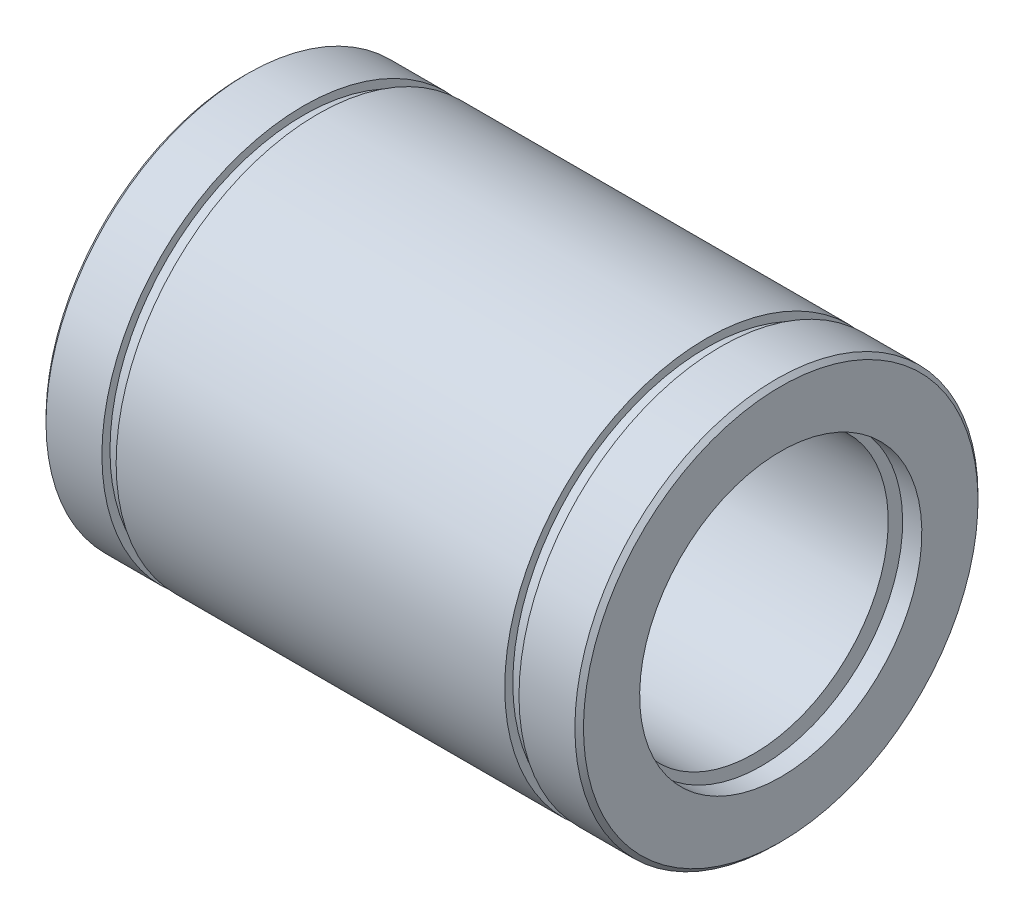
ISO-10303-21;
HEADER;
FILE_DESCRIPTION(('STEP AP214'),'2;1');
FILE_NAME('part.step','',(''),(''),'','','');
FILE_SCHEMA(('AUTOMOTIVE_DESIGN { 1 0 10303 214 1 1 1 1 }'));
ENDSEC;
DATA;
#1=APPLICATION_CONTEXT('core data for automotive mechanical design processes');
#2=APPLICATION_PROTOCOL_DEFINITION('international standard','automotive_design',2000,#1);
#3=PRODUCT_CONTEXT('',#1,'mechanical');
#4=PRODUCT('Part','Part','',(#3));
#5=PRODUCT_RELATED_PRODUCT_CATEGORY('part','',(#4));
#6=PRODUCT_DEFINITION_FORMATION('','',#4);
#7=PRODUCT_DEFINITION_CONTEXT('part definition',#1,'design');
#8=PRODUCT_DEFINITION('design','',#6,#7);
#9=PRODUCT_DEFINITION_SHAPE('','',#8);
#10=(LENGTH_UNIT() NAMED_UNIT(*) SI_UNIT(.MILLI.,.METRE.));
#11=(NAMED_UNIT(*) PLANE_ANGLE_UNIT() SI_UNIT($,.RADIAN.));
#12=(NAMED_UNIT(*) SI_UNIT($,.STERADIAN.) SOLID_ANGLE_UNIT());
#13=UNCERTAINTY_MEASURE_WITH_UNIT(LENGTH_MEASURE(1.E-05),#10,'distance_accuracy_value','');
#14=(GEOMETRIC_REPRESENTATION_CONTEXT(3) GLOBAL_UNCERTAINTY_ASSIGNED_CONTEXT((#13)) GLOBAL_UNIT_ASSIGNED_CONTEXT((#10,
#11,#12)) REPRESENTATION_CONTEXT('',''));
#15=CARTESIAN_POINT('',(0.,0.,0.));
#16=DIRECTION('',(0.,0.,1.));
#17=DIRECTION('',(1.,0.,0.));
#18=AXIS2_PLACEMENT_3D('',#15,#16,#17);
#19=CARTESIAN_POINT('',(0.,31.475,0.));
#20=DIRECTION('',(-1.,0.,0.));
#21=DIRECTION('',(0.,0.,1.));
#22=AXIS2_PLACEMENT_3D('',#19,#20,#21);
#23=PLANE('',#22);
#24=CARTESIAN_POINT('',(0.,0.,0.));
#25=DIRECTION('',(-1.,0.,0.));
#26=DIRECTION('',(0.,1.,0.));
#27=AXIS2_PLACEMENT_3D('',#24,#25,#26);
#28=CIRCLE('',#27,26.25);
#29=CARTESIAN_POINT('',(0.,-26.25,0.));
#30=VERTEX_POINT('',#29);
#31=EDGE_CURVE('E179',#30,#30,#28,.T.);
#32=ORIENTED_EDGE('',*,*,#31,.F.);
#33=EDGE_LOOP('',(#32));
#34=FACE_BOUND('',#33,.T.);
#35=CARTESIAN_POINT('',(0.,0.,0.));
#36=DIRECTION('',(-1.,0.,0.));
#37=DIRECTION('',(0.,1.,0.));
#38=AXIS2_PLACEMENT_3D('',#35,#36,#37);
#39=CIRCLE('',#38,36.7);
#40=CARTESIAN_POINT('',(0.,-36.7,0.));
#41=VERTEX_POINT('',#40);
#42=EDGE_CURVE('E140',#41,#41,#39,.T.);
#43=ORIENTED_EDGE('',*,*,#42,.T.);
#44=EDGE_LOOP('',(#43));
#45=FACE_BOUND('',#44,.T.);
#46=ADVANCED_FACE('F16',(#34,#45),#23,.T.);
#47=CARTESIAN_POINT('',(100.,31.475,0.));
#48=DIRECTION('',(1.,0.,0.));
#49=DIRECTION('',(0.,1.,0.));
#50=AXIS2_PLACEMENT_3D('',#47,#48,#49);
#51=PLANE('',#50);
#52=CARTESIAN_POINT('',(100.,0.,0.));
#53=DIRECTION('',(-1.,0.,0.));
#54=DIRECTION('',(0.,1.,0.));
#55=AXIS2_PLACEMENT_3D('',#52,#53,#54);
#56=CIRCLE('',#55,26.25);
#57=CARTESIAN_POINT('',(100.,-26.25,0.));
#58=VERTEX_POINT('',#57);
#59=EDGE_CURVE('E174',#58,#58,#56,.T.);
#60=ORIENTED_EDGE('',*,*,#59,.T.);
#61=EDGE_LOOP('',(#60));
#62=FACE_BOUND('',#61,.T.);
#63=CARTESIAN_POINT('',(100.,0.,0.));
#64=DIRECTION('',(-1.,0.,0.));
#65=DIRECTION('',(0.,1.,0.));
#66=AXIS2_PLACEMENT_3D('',#63,#64,#65);
#67=CIRCLE('',#66,36.7);
#68=CARTESIAN_POINT('',(100.,-36.7,0.));
#69=VERTEX_POINT('',#68);
#70=EDGE_CURVE('E192',#69,#69,#67,.T.);
#71=ORIENTED_EDGE('',*,*,#70,.F.);
#72=EDGE_LOOP('',(#71));
#73=FACE_BOUND('',#72,.T.);
#74=ADVANCED_FACE('F274',(#62,#73),#51,.T.);
#75=CARTESIAN_POINT('',(96.4285714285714,27.5,0.));
#76=DIRECTION('',(-1.,0.,0.));
#77=DIRECTION('',(0.,0.,1.));
#78=AXIS2_PLACEMENT_3D('',#75,#76,#77);
#79=PLANE('',#78);
#80=CARTESIAN_POINT('',(96.4285714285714,0.,0.));
#81=DIRECTION('',(-1.,0.,0.));
#82=DIRECTION('',(0.,1.,0.));
#83=AXIS2_PLACEMENT_3D('',#80,#81,#82);
#84=CIRCLE('',#83,26.25);
#85=CARTESIAN_POINT('',(96.4285714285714,-26.25,0.));
#86=VERTEX_POINT('',#85);
#87=EDGE_CURVE('E175',#86,#86,#84,.T.);
#88=ORIENTED_EDGE('',*,*,#87,.F.);
#89=EDGE_LOOP('',(#88));
#90=FACE_BOUND('',#89,.T.);
#91=CARTESIAN_POINT('',(96.4285714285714,0.,0.));
#92=DIRECTION('',(-1.,0.,0.));
#93=DIRECTION('',(0.,1.,0.));
#94=AXIS2_PLACEMENT_3D('',#91,#92,#93);
#95=CIRCLE('',#94,28.75);
#96=CARTESIAN_POINT('',(96.4285714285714,-28.75,0.));
#97=VERTEX_POINT('',#96);
#98=EDGE_CURVE('E156',#97,#97,#95,.T.);
#99=ORIENTED_EDGE('',*,*,#98,.T.);
#100=EDGE_LOOP('',(#99));
#101=FACE_BOUND('',#100,.T.);
#102=ADVANCED_FACE('F279',(#90,#101),#79,.T.);
#103=CARTESIAN_POINT('',(95.,26.875,0.));
#104=DIRECTION('',(1.,0.,0.));
#105=DIRECTION('',(0.,1.,0.));
#106=AXIS2_PLACEMENT_3D('',#103,#104,#105);
#107=PLANE('',#106);
#108=CARTESIAN_POINT('',(95.,0.,0.));
#109=DIRECTION('',(-1.,0.,0.));
#110=DIRECTION('',(0.,1.,0.));
#111=AXIS2_PLACEMENT_3D('',#108,#109,#110);
#112=CIRCLE('',#111,25.);
#113=CARTESIAN_POINT('',(95.,-25.,0.));
#114=VERTEX_POINT('',#113);
#115=EDGE_CURVE('E213',#114,#114,#112,.T.);
#116=ORIENTED_EDGE('',*,*,#115,.T.);
#117=EDGE_LOOP('',(#116));
#118=FACE_BOUND('',#117,.T.);
#119=CARTESIAN_POINT('',(95.,0.,0.));
#120=DIRECTION('',(-1.,0.,0.));
#121=DIRECTION('',(0.,1.,0.));
#122=AXIS2_PLACEMENT_3D('',#119,#120,#121);
#123=CIRCLE('',#122,28.75);
#124=CARTESIAN_POINT('',(95.,-28.75,0.));
#125=VERTEX_POINT('',#124);
#126=EDGE_CURVE('E157',#125,#125,#123,.T.);
#127=ORIENTED_EDGE('',*,*,#126,.F.);
#128=EDGE_LOOP('',(#127));
#129=FACE_BOUND('',#128,.T.);
#130=ADVANCED_FACE('F298',(#118,#129),#107,.T.);
#131=CARTESIAN_POINT('',(5.,26.875,0.));
#132=DIRECTION('',(-1.,0.,0.));
#133=DIRECTION('',(0.,0.,1.));
#134=AXIS2_PLACEMENT_3D('',#131,#132,#133);
#135=PLANE('',#134);
#136=CARTESIAN_POINT('',(5.,0.,0.));
#137=DIRECTION('',(-1.,0.,0.));
#138=DIRECTION('',(0.,1.,0.));
#139=AXIS2_PLACEMENT_3D('',#136,#137,#138);
#140=CIRCLE('',#139,25.);
#141=CARTESIAN_POINT('',(5.,-25.,0.));
#142=VERTEX_POINT('',#141);
#143=EDGE_CURVE('E195',#142,#142,#140,.T.);
#144=ORIENTED_EDGE('',*,*,#143,.F.);
#145=EDGE_LOOP('',(#144));
#146=FACE_BOUND('',#145,.T.);
#147=CARTESIAN_POINT('',(5.,0.,0.));
#148=DIRECTION('',(-1.,0.,0.));
#149=DIRECTION('',(0.,1.,0.));
#150=AXIS2_PLACEMENT_3D('',#147,#148,#149);
#151=CIRCLE('',#150,28.75);
#152=CARTESIAN_POINT('',(5.,-28.75,0.));
#153=VERTEX_POINT('',#152);
#154=EDGE_CURVE('E184',#153,#153,#151,.T.);
#155=ORIENTED_EDGE('',*,*,#154,.T.);
#156=EDGE_LOOP('',(#155));
#157=FACE_BOUND('',#156,.T.);
#158=ADVANCED_FACE('F290',(#146,#157),#135,.T.);
#159=CARTESIAN_POINT('',(3.57142857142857,27.5,0.));
#160=DIRECTION('',(1.,0.,0.));
#161=DIRECTION('',(0.,-1.,0.));
#162=AXIS2_PLACEMENT_3D('',#159,#160,#161);
#163=PLANE('',#162);
#164=CARTESIAN_POINT('',(3.57142857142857,0.,0.));
#165=DIRECTION('',(-1.,0.,0.));
#166=DIRECTION('',(0.,1.,0.));
#167=AXIS2_PLACEMENT_3D('',#164,#165,#166);
#168=CIRCLE('',#167,26.25);
#169=CARTESIAN_POINT('',(3.57142857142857,-26.25,0.));
#170=VERTEX_POINT('',#169);
#171=EDGE_CURVE('E229',#170,#170,#168,.T.);
#172=ORIENTED_EDGE('',*,*,#171,.T.);
#173=EDGE_LOOP('',(#172));
#174=FACE_BOUND('',#173,.T.);
#175=CARTESIAN_POINT('',(3.57142857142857,0.,0.));
#176=DIRECTION('',(-1.,0.,0.));
#177=DIRECTION('',(0.,1.,0.));
#178=AXIS2_PLACEMENT_3D('',#175,#176,#177);
#179=CIRCLE('',#178,28.75);
#180=CARTESIAN_POINT('',(3.57142857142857,-28.75,0.));
#181=VERTEX_POINT('',#180);
#182=EDGE_CURVE('E216',#181,#181,#179,.T.);
#183=ORIENTED_EDGE('',*,*,#182,.F.);
#184=EDGE_LOOP('',(#183));
#185=FACE_BOUND('',#184,.T.);
#186=ADVANCED_FACE('F287',(#174,#185),#163,.T.);
#187=CARTESIAN_POINT('',(11.2,0.,0.));
#188=DIRECTION('',(1.,0.,0.));
#189=DIRECTION('',(0.,1.,0.));
#190=AXIS2_PLACEMENT_3D('',#187,#188,#189);
#191=PLANE('',#190);
#192=CARTESIAN_POINT('',(11.2,0.,0.));
#193=DIRECTION('',(1.,0.,0.));
#194=DIRECTION('',(0.,0.,-1.));
#195=AXIS2_PLACEMENT_3D('',#192,#193,#194);
#196=CIRCLE('',#195,36.);
#197=CARTESIAN_POINT('',(11.2,0.,36.));
#198=VERTEX_POINT('',#197);
#199=EDGE_CURVE('E133',#198,#198,#196,.T.);
#200=ORIENTED_EDGE('',*,*,#199,.F.);
#201=EDGE_LOOP('',(#200));
#202=FACE_BOUND('',#201,.T.);
#203=CARTESIAN_POINT('',(11.2,0.,0.));
#204=DIRECTION('',(-1.,0.,0.));
#205=DIRECTION('',(0.,1.,0.));
#206=AXIS2_PLACEMENT_3D('',#203,#204,#205);
#207=CIRCLE('',#206,37.5);
#208=CARTESIAN_POINT('',(11.2,-37.5,0.));
#209=VERTEX_POINT('',#208);
#210=EDGE_CURVE('E131',#209,#209,#207,.T.);
#211=ORIENTED_EDGE('',*,*,#210,.F.);
#212=EDGE_LOOP('',(#211));
#213=FACE_BOUND('',#212,.T.);
#214=ADVANCED_FACE('F268',(#202,#213),#191,.T.);
#215=CARTESIAN_POINT('',(13.85,0.,0.));
#216=DIRECTION('',(1.,0.,0.));
#217=DIRECTION('',(0.,1.,0.));
#218=AXIS2_PLACEMENT_3D('',#215,#216,#217);
#219=PLANE('',#218);
#220=CARTESIAN_POINT('',(13.85,0.,0.));
#221=DIRECTION('',(1.,0.,0.));
#222=DIRECTION('',(0.,0.,-1.));
#223=AXIS2_PLACEMENT_3D('',#220,#221,#222);
#224=CIRCLE('',#223,36.);
#225=CARTESIAN_POINT('',(13.85,0.,36.));
#226=VERTEX_POINT('',#225);
#227=EDGE_CURVE('E237',#226,#226,#224,.T.);
#228=ORIENTED_EDGE('',*,*,#227,.T.);
#229=EDGE_LOOP('',(#228));
#230=FACE_BOUND('',#229,.T.);
#231=CARTESIAN_POINT('',(13.85,0.,0.));
#232=DIRECTION('',(1.,0.,0.));
#233=DIRECTION('',(0.,1.,0.));
#234=AXIS2_PLACEMENT_3D('',#231,#232,#233);
#235=CIRCLE('',#234,37.5);
#236=CARTESIAN_POINT('',(13.85,-37.5,0.));
#237=VERTEX_POINT('',#236);
#238=EDGE_CURVE('E158',#237,#237,#235,.T.);
#239=ORIENTED_EDGE('',*,*,#238,.F.);
#240=EDGE_LOOP('',(#239));
#241=FACE_BOUND('',#240,.T.);
#242=ADVANCED_FACE('F258',(#230,#241),#219,.F.);
#243=CARTESIAN_POINT('',(88.8,0.,0.));
#244=DIRECTION('',(1.,0.,0.));
#245=DIRECTION('',(0.,1.,0.));
#246=AXIS2_PLACEMENT_3D('',#243,#244,#245);
#247=PLANE('',#246);
#248=CARTESIAN_POINT('',(88.8,0.,0.));
#249=DIRECTION('',(1.,0.,0.));
#250=DIRECTION('',(0.,0.,-1.));
#251=AXIS2_PLACEMENT_3D('',#248,#249,#250);
#252=CIRCLE('',#251,36.);
#253=CARTESIAN_POINT('',(88.8,0.,36.));
#254=VERTEX_POINT('',#253);
#255=EDGE_CURVE('E166',#254,#254,#252,.T.);
#256=ORIENTED_EDGE('',*,*,#255,.T.);
#257=EDGE_LOOP('',(#256));
#258=FACE_BOUND('',#257,.T.);
#259=CARTESIAN_POINT('',(88.8,0.,0.));
#260=DIRECTION('',(1.,0.,0.));
#261=DIRECTION('',(0.,1.,0.));
#262=AXIS2_PLACEMENT_3D('',#259,#260,#261);
#263=CIRCLE('',#262,37.5);
#264=CARTESIAN_POINT('',(88.8,-37.5,0.));
#265=VERTEX_POINT('',#264);
#266=EDGE_CURVE('E169',#265,#265,#263,.T.);
#267=ORIENTED_EDGE('',*,*,#266,.F.);
#268=EDGE_LOOP('',(#267));
#269=FACE_BOUND('',#268,.T.);
#270=ADVANCED_FACE('F255',(#258,#269),#247,.F.);
#271=CARTESIAN_POINT('',(86.15,0.,0.));
#272=DIRECTION('',(1.,0.,0.));
#273=DIRECTION('',(0.,1.,0.));
#274=AXIS2_PLACEMENT_3D('',#271,#272,#273);
#275=PLANE('',#274);
#276=CARTESIAN_POINT('',(86.15,0.,0.));
#277=DIRECTION('',(-1.,0.,0.));
#278=DIRECTION('',(0.,0.,-1.));
#279=AXIS2_PLACEMENT_3D('',#276,#277,#278);
#280=CIRCLE('',#279,36.);
#281=CARTESIAN_POINT('',(86.15,0.,36.));
#282=VERTEX_POINT('',#281);
#283=EDGE_CURVE('E10',#282,#282,#280,.T.);
#284=ORIENTED_EDGE('',*,*,#283,.T.);
#285=EDGE_LOOP('',(#284));
#286=FACE_BOUND('',#285,.T.);
#287=CARTESIAN_POINT('',(86.15,0.,0.));
#288=DIRECTION('',(-1.,0.,0.));
#289=DIRECTION('',(0.,1.,0.));
#290=AXIS2_PLACEMENT_3D('',#287,#288,#289);
#291=CIRCLE('',#290,37.5);
#292=CARTESIAN_POINT('',(86.15,-37.5,0.));
#293=VERTEX_POINT('',#292);
#294=EDGE_CURVE('E148',#293,#293,#291,.T.);
#295=ORIENTED_EDGE('',*,*,#294,.F.);
#296=EDGE_LOOP('',(#295));
#297=FACE_BOUND('',#296,.T.);
#298=ADVANCED_FACE('F257',(#286,#297),#275,.T.);
#299=CARTESIAN_POINT('',(88.8,0.,0.));
#300=DIRECTION('',(1.,0.,0.));
#301=DIRECTION('',(0.,0.,-1.));
#302=AXIS2_PLACEMENT_3D('',#299,#300,#301);
#303=CYLINDRICAL_SURFACE('',#302,36.);
#304=ORIENTED_EDGE('',*,*,#255,.F.);
#305=DIRECTION('',(-1.,0.,0.));
#306=VECTOR('',#305,1.);
#307=CARTESIAN_POINT('',(88.8,0.,36.));
#308=LINE('',#307,#306);
#309=EDGE_CURVE('E19',#254,#282,#308,.T.);
#310=ORIENTED_EDGE('',*,*,#309,.T.);
#311=ORIENTED_EDGE('',*,*,#283,.F.);
#312=ORIENTED_EDGE('',*,*,#309,.F.);
#313=EDGE_LOOP('',(#304,#310,#311,#312));
#314=FACE_BOUND('',#313,.T.);
#315=ADVANCED_FACE('F266',(#314),#303,.T.);
#316=CARTESIAN_POINT('',(50.,0.,0.));
#317=DIRECTION('',(1.,0.,0.));
#318=DIRECTION('',(0.,1.,0.));
#319=AXIS2_PLACEMENT_3D('',#316,#317,#318);
#320=CYLINDRICAL_SURFACE('',#319,37.5);
#321=CARTESIAN_POINT('',(99.2,0.,0.));
#322=DIRECTION('',(-1.,0.,0.));
#323=DIRECTION('',(0.,1.,0.));
#324=AXIS2_PLACEMENT_3D('',#321,#322,#323);
#325=CIRCLE('',#324,37.5);
#326=CARTESIAN_POINT('',(99.2,-37.5,0.));
#327=VERTEX_POINT('',#326);
#328=EDGE_CURVE('E160',#327,#327,#325,.T.);
#329=ORIENTED_EDGE('',*,*,#328,.T.);
#330=DIRECTION('',(-1.,0.,0.));
#331=VECTOR('',#330,1.);
#332=CARTESIAN_POINT('',(50.,-37.5,0.));
#333=LINE('',#332,#331);
#334=EDGE_CURVE('E244',#327,#265,#333,.T.);
#335=ORIENTED_EDGE('',*,*,#334,.T.);
#336=ORIENTED_EDGE('',*,*,#266,.T.);
#337=ORIENTED_EDGE('',*,*,#334,.F.);
#338=EDGE_LOOP('',(#329,#335,#336,#337));
#339=FACE_BOUND('',#338,.T.);
#340=ADVANCED_FACE('F252',(#339),#320,.T.);
#341=CARTESIAN_POINT('',(11.2,0.,0.));
#342=DIRECTION('',(-1.,0.,0.));
#343=DIRECTION('',(0.,0.,-1.));
#344=AXIS2_PLACEMENT_3D('',#341,#342,#343);
#345=CYLINDRICAL_SURFACE('',#344,36.);
#346=ORIENTED_EDGE('',*,*,#199,.T.);
#347=DIRECTION('',(1.,0.,0.));
#348=VECTOR('',#347,1.);
#349=CARTESIAN_POINT('',(11.2,0.,36.));
#350=LINE('',#349,#348);
#351=EDGE_CURVE('E234',#198,#226,#350,.T.);
#352=ORIENTED_EDGE('',*,*,#351,.T.);
#353=ORIENTED_EDGE('',*,*,#227,.F.);
#354=ORIENTED_EDGE('',*,*,#351,.F.);
#355=EDGE_LOOP('',(#346,#352,#353,#354));
#356=FACE_BOUND('',#355,.T.);
#357=ADVANCED_FACE('F311',(#356),#345,.T.);
#358=CARTESIAN_POINT('',(50.,0.,0.));
#359=DIRECTION('',(1.,0.,0.));
#360=DIRECTION('',(0.,1.,0.));
#361=AXIS2_PLACEMENT_3D('',#358,#359,#360);
#362=CYLINDRICAL_SURFACE('',#361,37.5);
#363=ORIENTED_EDGE('',*,*,#210,.T.);
#364=DIRECTION('',(-1.,0.,0.));
#365=VECTOR('',#364,1.);
#366=CARTESIAN_POINT('',(50.,-37.5,0.));
#367=LINE('',#366,#365);
#368=CARTESIAN_POINT('',(0.8,-37.5,0.));
#369=VERTEX_POINT('',#368);
#370=EDGE_CURVE('E125',#209,#369,#367,.T.);
#371=ORIENTED_EDGE('',*,*,#370,.T.);
#372=CARTESIAN_POINT('',(0.8,0.,0.));
#373=DIRECTION('',(-1.,0.,0.));
#374=DIRECTION('',(0.,1.,0.));
#375=AXIS2_PLACEMENT_3D('',#372,#373,#374);
#376=CIRCLE('',#375,37.5);
#377=EDGE_CURVE('E129',#369,#369,#376,.T.);
#378=ORIENTED_EDGE('',*,*,#377,.F.);
#379=ORIENTED_EDGE('',*,*,#370,.F.);
#380=EDGE_LOOP('',(#363,#371,#378,#379));
#381=FACE_BOUND('',#380,.T.);
#382=ADVANCED_FACE('F127',(#381),#362,.T.);
#383=CARTESIAN_POINT('',(1.78571428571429,0.,0.));
#384=DIRECTION('',(1.,0.,0.));
#385=DIRECTION('',(0.,1.,0.));
#386=AXIS2_PLACEMENT_3D('',#383,#384,#385);
#387=CYLINDRICAL_SURFACE('',#386,26.25);
#388=ORIENTED_EDGE('',*,*,#31,.T.);
#389=DIRECTION('',(1.,0.,0.));
#390=VECTOR('',#389,1.);
#391=CARTESIAN_POINT('',(1.78571428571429,-26.25,0.));
#392=LINE('',#391,#390);
#393=EDGE_CURVE('E183',#30,#170,#392,.T.);
#394=ORIENTED_EDGE('',*,*,#393,.T.);
#395=ORIENTED_EDGE('',*,*,#171,.F.);
#396=ORIENTED_EDGE('',*,*,#393,.F.);
#397=EDGE_LOOP('',(#388,#394,#395,#396));
#398=FACE_BOUND('',#397,.T.);
#399=ADVANCED_FACE('F284',(#398),#387,.F.);
#400=CARTESIAN_POINT('',(4.28571428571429,0.,0.));
#401=DIRECTION('',(1.,0.,0.));
#402=DIRECTION('',(0.,1.,0.));
#403=AXIS2_PLACEMENT_3D('',#400,#401,#402);
#404=CYLINDRICAL_SURFACE('',#403,28.75);
#405=ORIENTED_EDGE('',*,*,#182,.T.);
#406=DIRECTION('',(1.,0.,0.));
#407=VECTOR('',#406,1.);
#408=CARTESIAN_POINT('',(4.28571428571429,-28.75,0.));
#409=LINE('',#408,#407);
#410=EDGE_CURVE('E220',#181,#153,#409,.T.);
#411=ORIENTED_EDGE('',*,*,#410,.T.);
#412=ORIENTED_EDGE('',*,*,#154,.F.);
#413=ORIENTED_EDGE('',*,*,#410,.F.);
#414=EDGE_LOOP('',(#405,#411,#412,#413));
#415=FACE_BOUND('',#414,.T.);
#416=ADVANCED_FACE('F294',(#415),#404,.F.);
#417=CARTESIAN_POINT('',(50.,0.,0.));
#418=DIRECTION('',(1.,0.,0.));
#419=DIRECTION('',(0.,1.,0.));
#420=AXIS2_PLACEMENT_3D('',#417,#418,#419);
#421=CYLINDRICAL_SURFACE('',#420,25.);
#422=ORIENTED_EDGE('',*,*,#143,.T.);
#423=DIRECTION('',(1.,0.,0.));
#424=VECTOR('',#423,1.);
#425=CARTESIAN_POINT('',(50.,-25.,0.));
#426=LINE('',#425,#424);
#427=EDGE_CURVE('E209',#142,#114,#426,.T.);
#428=ORIENTED_EDGE('',*,*,#427,.T.);
#429=ORIENTED_EDGE('',*,*,#115,.F.);
#430=ORIENTED_EDGE('',*,*,#427,.F.);
#431=EDGE_LOOP('',(#422,#428,#429,#430));
#432=FACE_BOUND('',#431,.T.);
#433=ADVANCED_FACE('F324',(#432),#421,.F.);
#434=CARTESIAN_POINT('',(95.7142857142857,0.,0.));
#435=DIRECTION('',(1.,0.,0.));
#436=DIRECTION('',(0.,1.,0.));
#437=AXIS2_PLACEMENT_3D('',#434,#435,#436);
#438=CYLINDRICAL_SURFACE('',#437,28.75);
#439=ORIENTED_EDGE('',*,*,#126,.T.);
#440=DIRECTION('',(1.,0.,0.));
#441=VECTOR('',#440,1.);
#442=CARTESIAN_POINT('',(95.7142857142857,-28.75,0.));
#443=LINE('',#442,#441);
#444=EDGE_CURVE('E152',#125,#97,#443,.T.);
#445=ORIENTED_EDGE('',*,*,#444,.T.);
#446=ORIENTED_EDGE('',*,*,#98,.F.);
#447=ORIENTED_EDGE('',*,*,#444,.F.);
#448=EDGE_LOOP('',(#439,#445,#446,#447));
#449=FACE_BOUND('',#448,.T.);
#450=ADVANCED_FACE('F326',(#449),#438,.F.);
#451=CARTESIAN_POINT('',(98.2142857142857,0.,0.));
#452=DIRECTION('',(1.,0.,0.));
#453=DIRECTION('',(0.,1.,0.));
#454=AXIS2_PLACEMENT_3D('',#451,#452,#453);
#455=CYLINDRICAL_SURFACE('',#454,26.25);
#456=ORIENTED_EDGE('',*,*,#87,.T.);
#457=DIRECTION('',(1.,0.,0.));
#458=VECTOR('',#457,1.);
#459=CARTESIAN_POINT('',(98.2142857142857,-26.25,0.));
#460=LINE('',#459,#458);
#461=EDGE_CURVE('E170',#86,#58,#460,.T.);
#462=ORIENTED_EDGE('',*,*,#461,.T.);
#463=ORIENTED_EDGE('',*,*,#59,.F.);
#464=ORIENTED_EDGE('',*,*,#461,.F.);
#465=EDGE_LOOP('',(#456,#462,#463,#464));
#466=FACE_BOUND('',#465,.T.);
#467=ADVANCED_FACE('F331',(#466),#455,.F.);
#468=CARTESIAN_POINT('',(99.6,0.,0.));
#469=DIRECTION('',(-1.,0.,0.));
#470=DIRECTION('',(0.,1.,0.));
#471=AXIS2_PLACEMENT_3D('',#468,#469,#470);
#472=CONICAL_SURFACE('',#471,37.1,0.785398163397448);
#473=ORIENTED_EDGE('',*,*,#328,.F.);
#474=DIRECTION('',(0.707106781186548,0.707106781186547,0.));
#475=VECTOR('',#474,1.);
#476=CARTESIAN_POINT('',(99.6,-37.1,0.));
#477=LINE('',#476,#475);
#478=EDGE_CURVE('E188',#327,#69,#477,.T.);
#479=ORIENTED_EDGE('',*,*,#478,.T.);
#480=ORIENTED_EDGE('',*,*,#70,.T.);
#481=ORIENTED_EDGE('',*,*,#478,.F.);
#482=EDGE_LOOP('',(#473,#479,#480,#481));
#483=FACE_BOUND('',#482,.T.);
#484=ADVANCED_FACE('F342',(#483),#472,.T.);
#485=CARTESIAN_POINT('',(50.,0.,0.));
#486=DIRECTION('',(1.,0.,0.));
#487=DIRECTION('',(0.,1.,0.));
#488=AXIS2_PLACEMENT_3D('',#485,#486,#487);
#489=CYLINDRICAL_SURFACE('',#488,37.5);
#490=ORIENTED_EDGE('',*,*,#294,.T.);
#491=DIRECTION('',(-1.,0.,0.));
#492=VECTOR('',#491,1.);
#493=CARTESIAN_POINT('',(50.,-37.5,0.));
#494=LINE('',#493,#492);
#495=EDGE_CURVE('E161',#293,#237,#494,.T.);
#496=ORIENTED_EDGE('',*,*,#495,.T.);
#497=ORIENTED_EDGE('',*,*,#238,.T.);
#498=ORIENTED_EDGE('',*,*,#495,.F.);
#499=EDGE_LOOP('',(#490,#496,#497,#498));
#500=FACE_BOUND('',#499,.T.);
#501=ADVANCED_FACE('F347',(#500),#489,.T.);
#502=CARTESIAN_POINT('',(0.4,0.,0.));
#503=DIRECTION('',(1.,0.,0.));
#504=DIRECTION('',(0.,1.,0.));
#505=AXIS2_PLACEMENT_3D('',#502,#503,#504);
#506=CONICAL_SURFACE('',#505,37.1,0.785398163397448);
#507=ORIENTED_EDGE('',*,*,#377,.T.);
#508=DIRECTION('',(-0.707106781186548,0.707106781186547,0.));
#509=VECTOR('',#508,1.);
#510=CARTESIAN_POINT('',(0.4,-37.1,0.));
#511=LINE('',#510,#509);
#512=EDGE_CURVE('E138',#369,#41,#511,.T.);
#513=ORIENTED_EDGE('',*,*,#512,.T.);
#514=ORIENTED_EDGE('',*,*,#42,.F.);
#515=ORIENTED_EDGE('',*,*,#512,.F.);
#516=EDGE_LOOP('',(#507,#513,#514,#515));
#517=FACE_BOUND('',#516,.T.);
#518=ADVANCED_FACE('F139',(#517),#506,.T.);
#519=CLOSED_SHELL('',(#46,#74,#102,#130,#158,#186,#214,#242,#270,#298,#315,#340,#357,#382,#399,
#416,#433,#450,#467,#484,#501,#518));
#520=MANIFOLD_SOLID_BREP('B1',#519);
#521=ADVANCED_BREP_SHAPE_REPRESENTATION('',(#18,#520),#14);
#522=SHAPE_DEFINITION_REPRESENTATION(#9,#521);
ENDSEC;
END-ISO-10303-21;
